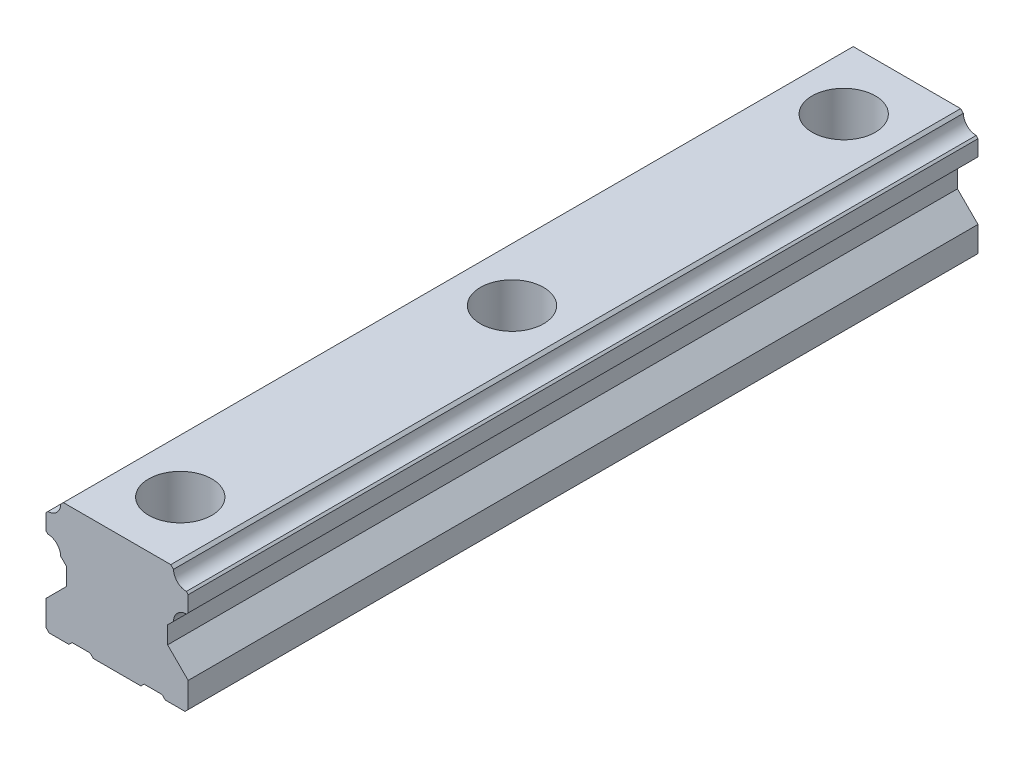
from build123d import *

# Parameters (mm, degrees)
BOSS_EXTRUDE1_DEPTH                                  = 250
CBORE_FOR_M12_HEX_SOCKET_HEAD_CAP_SCREW1_D           = 14
CBORE_FOR_M12_HEX_SOCKET_HEAD_CAP_SCREW1_CBORE_D     = 20
CBORE_FOR_M12_HEX_SOCKET_HEAD_CAP_SCREW1_CBORE_DEPTH = 17
LPATTERN1_COUNT                                      = 3
LPATTERN1_PITCH                                      = 105


with BuildPart() as part:
    # Sketch1 → Boss-Extrude1 (new body)
    with BuildSketch(Plane.XY):
        with BuildLine():
            Line((21.907169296, 33.092830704), (22.5, 32.5))
            Line((22.5, 32.5), (22.5, 27.5))
            Line((22.5, 27.5), (21.909209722, 26.909209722))
            ThreePointArc((21.909209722, 26.909209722), (19.069648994, 25.700351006), (17.860790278, 22.860790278))
            Line((17.860790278, 22.860790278), (16, 21))
            Line((16, 21), (16, 15.5))
            Line((16, 15.5), (22.5, 9))
            Line((22.5, 9), (22.5, 1))
            Line((22.5, 1), (21.5, 0))
            Line((21.5, 0), (15.25, 0))
            Line((15.25, 0), (14.25, 1))
            Line((14.25, 1), (8.55, 1))
            Line((8.55, 1), (7.55, 0))
            Line((7.55, 0), (-7.55, 0))
            Line((-7.55, 0), (-8.55, 1))
            Line((-8.55, 1), (-14.25, 1))
            Line((-14.25, 1), (-15.25, 0))
            Line((-15.25, 0), (-21.5, 0))
            Line((-21.5, 0), (-22.5, 1))
            Line((-22.5, 1), (-22.5, 9))
            Line((-22.5, 9), (-16, 15.5))
            Line((-16, 15.5), (-16, 21))
            Line((-16, 21), (-17.860790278, 22.860790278))
            ThreePointArc((-17.860790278, 22.860790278), (-19.069648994, 25.700351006), (-21.909209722, 26.909209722))
            Line((-21.909209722, 26.909209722), (-22.5, 27.5))
            Line((-22.5, 27.5), (-22.5, 32.5))
            Line((-22.5, 32.5), (-21.907169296, 33.092830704))
            ThreePointArc((-21.907169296, 33.092830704), (-19.069648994, 34.301648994), (-17.860830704, 37.139169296))
            Line((-17.860830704, 37.139169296), (-17, 38))
            Line((-17, 38), (17, 38))
            Line((17, 38), (17.860830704, 37.139169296))
            ThreePointArc((17.860830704, 37.139169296), (19.069648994, 34.301648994), (21.907169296, 33.092830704))
        make_face()
    extrude(amount=-BOSS_EXTRUDE1_DEPTH)

    # CBORE for M12 Hex Socket Head Cap Screw1 (through all)
    with Locations(Plane(origin=(0, 38, 0), x_dir=(1, 0, 0), z_dir=(0, 1, 0))):
        with Locations((0, 20)):
            cbore_for_m12_hex_socket_head_cap_screw1 = CounterBoreHole(CBORE_FOR_M12_HEX_SOCKET_HEAD_CAP_SCREW1_D / 2, CBORE_FOR_M12_HEX_SOCKET_HEAD_CAP_SCREW1_CBORE_D / 2, CBORE_FOR_M12_HEX_SOCKET_HEAD_CAP_SCREW1_CBORE_DEPTH)

    # LPattern1: CBORE for M12 Hex Socket Head Cap Screw1 ×3
    with Locations(*[(0, 0, -i * LPATTERN1_PITCH) for i in range(1, LPATTERN1_COUNT)]):
        add(cbore_for_m12_hex_socket_head_cap_screw1, mode=Mode.SUBTRACT)


solid = part.part
